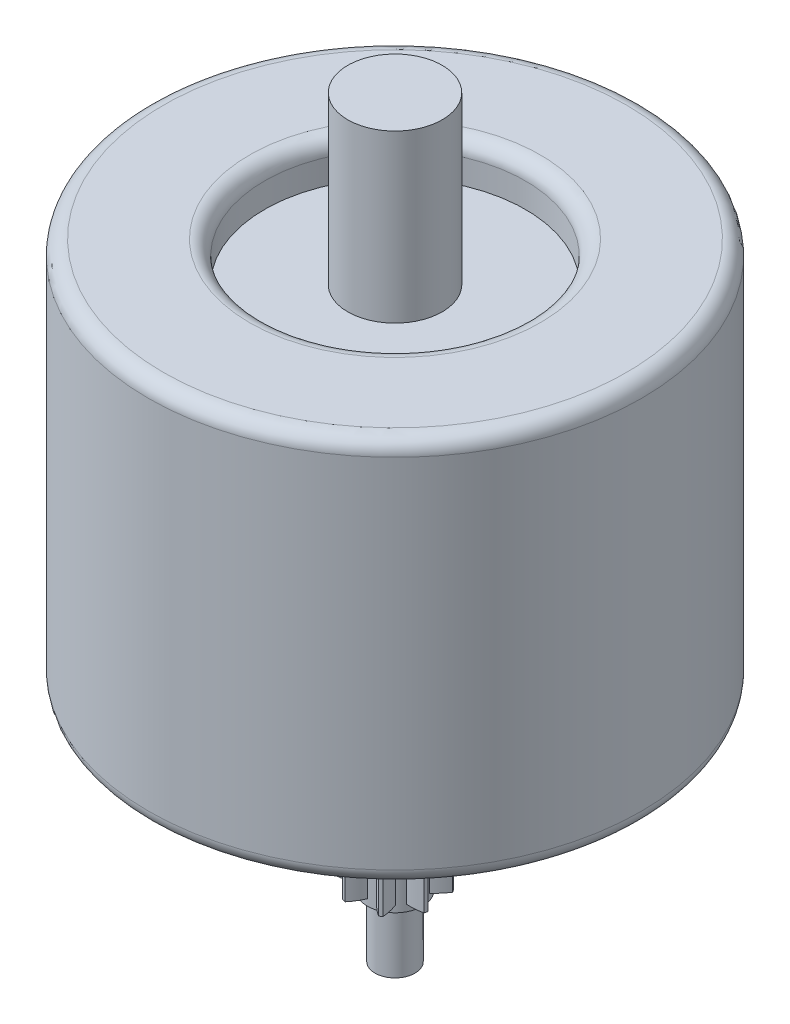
ISO-10303-21;
HEADER;
FILE_DESCRIPTION(('STEP AP214'),'2;1');
FILE_NAME('part.step','',(''),(''),'','','');
FILE_SCHEMA(('AUTOMOTIVE_DESIGN { 1 0 10303 214 1 1 1 1 }'));
ENDSEC;
DATA;
#1=APPLICATION_CONTEXT('core data for automotive mechanical design processes');
#2=APPLICATION_PROTOCOL_DEFINITION('international standard','automotive_design',2000,#1);
#3=PRODUCT_CONTEXT('',#1,'mechanical');
#4=PRODUCT('Part','Part','',(#3));
#5=PRODUCT_RELATED_PRODUCT_CATEGORY('part','',(#4));
#6=PRODUCT_DEFINITION_FORMATION('','',#4);
#7=PRODUCT_DEFINITION_CONTEXT('part definition',#1,'design');
#8=PRODUCT_DEFINITION('design','',#6,#7);
#9=PRODUCT_DEFINITION_SHAPE('','',#8);
#10=(LENGTH_UNIT() NAMED_UNIT(*) SI_UNIT(.MILLI.,.METRE.));
#11=(NAMED_UNIT(*) PLANE_ANGLE_UNIT() SI_UNIT($,.RADIAN.));
#12=(NAMED_UNIT(*) SI_UNIT($,.STERADIAN.) SOLID_ANGLE_UNIT());
#13=UNCERTAINTY_MEASURE_WITH_UNIT(LENGTH_MEASURE(1.E-05),#10,'distance_accuracy_value','');
#14=(GEOMETRIC_REPRESENTATION_CONTEXT(3) GLOBAL_UNCERTAINTY_ASSIGNED_CONTEXT((#13)) GLOBAL_UNIT_ASSIGNED_CONTEXT((#10,
#11,#12)) REPRESENTATION_CONTEXT('',''));
#15=CARTESIAN_POINT('',(0.,0.,0.));
#16=DIRECTION('',(0.,0.,1.));
#17=DIRECTION('',(1.,0.,0.));
#18=AXIS2_PLACEMENT_3D('',#15,#16,#17);
#19=CARTESIAN_POINT('',(-3.6398935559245,3.2,0.211839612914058));
#20=DIRECTION('',(0.,-1.,0.));
#21=DIRECTION('',(0.,0.,-1.));
#22=AXIS2_PLACEMENT_3D('',#19,#20,#21);
#23=CYLINDRICAL_SURFACE('',#22,4.);
#24=DIRECTION('',(0.,1.,0.));
#25=VECTOR('',#24,1.);
#26=CARTESIAN_POINT('',(0.0160026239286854,-4.3,1.83493022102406));
#27=LINE('',#26,#25);
#28=CARTESIAN_POINT('',(0.016002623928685,3.2,1.83493022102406));
#29=VERTEX_POINT('',#28);
#30=CARTESIAN_POINT('',(0.0160026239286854,-11.36,1.83493022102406));
#31=VERTEX_POINT('',#30);
#32=EDGE_CURVE('E61',#29,#31,#27,.F.);
#33=ORIENTED_EDGE('',*,*,#32,.F.);
#34=CARTESIAN_POINT('',(-3.6398935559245,3.2,0.211839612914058));
#35=DIRECTION('',(0.,1.,0.));
#36=DIRECTION('',(0.,0.,1.));
#37=AXIS2_PLACEMENT_3D('',#34,#35,#36);
#38=CIRCLE('',#37,4.);
#39=CARTESIAN_POINT('',(-0.563406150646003,3.2,2.76824827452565));
#40=VERTEX_POINT('',#39);
#41=EDGE_CURVE('E445',#40,#29,#38,.T.);
#42=ORIENTED_EDGE('',*,*,#41,.F.);
#43=DIRECTION('',(0.,-1.,0.));
#44=VECTOR('',#43,1.);
#45=CARTESIAN_POINT('',(-0.563406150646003,3.2,2.76824827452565));
#46=LINE('',#45,#44);
#47=CARTESIAN_POINT('',(-0.563406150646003,-11.36,2.76824827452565));
#48=VERTEX_POINT('',#47);
#49=EDGE_CURVE('E453',#40,#48,#46,.T.);
#50=ORIENTED_EDGE('',*,*,#49,.T.);
#51=CARTESIAN_POINT('',(-3.6398935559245,-11.36,0.211839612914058));
#52=DIRECTION('',(0.,1.,0.));
#53=DIRECTION('',(0.,0.,1.));
#54=AXIS2_PLACEMENT_3D('',#51,#52,#53);
#55=CIRCLE('',#54,4.);
#56=EDGE_CURVE('E442',#48,#31,#55,.T.);
#57=ORIENTED_EDGE('',*,*,#56,.T.);
#58=EDGE_LOOP('',(#33,#42,#50,#57));
#59=FACE_BOUND('',#58,.T.);
#60=ADVANCED_FACE('F45',(#59),#23,.T.);
#61=CARTESIAN_POINT('',(3.53426422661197,3.2,-0.895922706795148));
#62=DIRECTION('',(0.,-1.,0.));
#63=DIRECTION('',(0.,0.,-1.));
#64=AXIS2_PLACEMENT_3D('',#61,#62,#63);
#65=CYLINDRICAL_SURFACE('',#64,4.);
#66=DIRECTION('',(0.,1.,0.));
#67=VECTOR('',#66,1.);
#68=CARTESIAN_POINT('',(0.538210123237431,-4.3,1.75429611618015));
#69=LINE('',#68,#67);
#70=CARTESIAN_POINT('',(0.538210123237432,-11.36,1.75429611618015));
#71=VERTEX_POINT('',#70);
#72=CARTESIAN_POINT('',(0.538210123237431,3.2,1.75429611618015));
#73=VERTEX_POINT('',#72);
#74=EDGE_CURVE('E339',#71,#73,#69,.T.);
#75=ORIENTED_EDGE('',*,*,#74,.F.);
#76=CARTESIAN_POINT('',(3.53426422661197,-11.36,-0.895922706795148));
#77=DIRECTION('',(0.,1.,0.));
#78=DIRECTION('',(0.,0.,1.));
#79=AXIS2_PLACEMENT_3D('',#76,#77,#78);
#80=CIRCLE('',#79,4.);
#81=CARTESIAN_POINT('',(1.37214864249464,-11.36,2.46937909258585));
#82=VERTEX_POINT('',#81);
#83=EDGE_CURVE('E448',#71,#82,#80,.T.);
#84=ORIENTED_EDGE('',*,*,#83,.T.);
#85=DIRECTION('',(0.,-1.,0.));
#86=VECTOR('',#85,1.);
#87=CARTESIAN_POINT('',(1.37214864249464,3.2,2.46937909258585));
#88=LINE('',#87,#86);
#89=CARTESIAN_POINT('',(1.37214864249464,3.2,2.46937909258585));
#90=VERTEX_POINT('',#89);
#91=EDGE_CURVE('E450',#90,#82,#88,.T.);
#92=ORIENTED_EDGE('',*,*,#91,.F.);
#93=CARTESIAN_POINT('',(3.53426422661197,3.2,-0.895922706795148));
#94=DIRECTION('',(0.,1.,0.));
#95=DIRECTION('',(0.,0.,1.));
#96=AXIS2_PLACEMENT_3D('',#93,#94,#95);
#97=CIRCLE('',#96,4.);
#98=EDGE_CURVE('E447',#73,#90,#97,.T.);
#99=ORIENTED_EDGE('',*,*,#98,.F.);
#100=EDGE_LOOP('',(#75,#84,#92,#99));
#101=FACE_BOUND('',#100,.T.);
#102=ADVANCED_FACE('F535',(#101),#65,.T.);
#103=CARTESIAN_POINT('',(-2.72358664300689,3.2,-2.42400018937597));
#104=DIRECTION('',(0.,-1.,0.));
#105=DIRECTION('',(0.,0.,-1.));
#106=AXIS2_PLACEMENT_3D('',#103,#104,#105);
#107=CYLINDRICAL_SURFACE('',#106,4.);
#108=DIRECTION('',(0.,1.,0.));
#109=VECTOR('',#108,1.);
#110=CARTESIAN_POINT('',(-1.28617603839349,-4.3,1.30880716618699));
#111=LINE('',#110,#109);
#112=CARTESIAN_POINT('',(-1.28617603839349,3.2,1.30880716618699));
#113=VERTEX_POINT('',#112);
#114=CARTESIAN_POINT('',(-1.28617603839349,-11.36,1.30880716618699));
#115=VERTEX_POINT('',#114);
#116=EDGE_CURVE('E323',#113,#115,#111,.F.);
#117=ORIENTED_EDGE('',*,*,#116,.F.);
#118=CARTESIAN_POINT('',(-2.72358664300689,3.2,-2.42400018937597));
#119=DIRECTION('',(0.,1.,0.));
#120=DIRECTION('',(-0.707106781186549,0.,0.707106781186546));
#121=AXIS2_PLACEMENT_3D('',#118,#119,#120);
#122=CIRCLE('',#121,4.);
#123=CARTESIAN_POINT('',(-2.35583543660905,3.2,1.55905881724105));
#124=VERTEX_POINT('',#123);
#125=EDGE_CURVE('E430',#124,#113,#122,.T.);
#126=ORIENTED_EDGE('',*,*,#125,.F.);
#127=DIRECTION('',(0.,-1.,0.));
#128=VECTOR('',#127,1.);
#129=CARTESIAN_POINT('',(-2.35583543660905,3.2,1.55905881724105));
#130=LINE('',#129,#128);
#131=CARTESIAN_POINT('',(-2.35583543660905,-11.36,1.55905881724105));
#132=VERTEX_POINT('',#131);
#133=EDGE_CURVE('E440',#124,#132,#130,.T.);
#134=ORIENTED_EDGE('',*,*,#133,.T.);
#135=CARTESIAN_POINT('',(-2.72358664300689,-11.36,-2.42400018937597));
#136=DIRECTION('',(0.,1.,0.));
#137=DIRECTION('',(-0.707106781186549,0.,0.707106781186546));
#138=AXIS2_PLACEMENT_3D('',#135,#136,#137);
#139=CIRCLE('',#138,4.);
#140=EDGE_CURVE('E414',#132,#115,#139,.T.);
#141=ORIENTED_EDGE('',*,*,#140,.T.);
#142=EDGE_LOOP('',(#117,#126,#134,#141));
#143=FACE_BOUND('',#142,.T.);
#144=ADVANCED_FACE('F541',(#143),#107,.T.);
#145=CARTESIAN_POINT('',(3.13261522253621,3.2,1.86558917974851));
#146=DIRECTION('',(0.,-1.,0.));
#147=DIRECTION('',(0.,0.,-1.));
#148=AXIS2_PLACEMENT_3D('',#145,#146,#147);
#149=CYLINDRICAL_SURFACE('',#148,4.);
#150=DIRECTION('',(0.,1.,0.));
#151=VECTOR('',#150,1.);
#152=CARTESIAN_POINT('',(-0.859902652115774,-4.3,1.62104670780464));
#153=LINE('',#152,#151);
#154=CARTESIAN_POINT('',(-0.859902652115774,-11.36,1.62104670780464));
#155=VERTEX_POINT('',#154);
#156=CARTESIAN_POINT('',(-0.859902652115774,3.2,1.62104670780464));
#157=VERTEX_POINT('',#156);
#158=EDGE_CURVE('E342',#155,#157,#153,.T.);
#159=ORIENTED_EDGE('',*,*,#158,.F.);
#160=CARTESIAN_POINT('',(3.13261522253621,-11.36,1.86558917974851));
#161=DIRECTION('',(0.,1.,0.));
#162=DIRECTION('',(-0.707106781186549,0.,0.707106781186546));
#163=AXIS2_PLACEMENT_3D('',#160,#161,#162);
#164=CIRCLE('',#163,4.);
#165=CARTESIAN_POINT('',(-0.775859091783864,-11.36,2.71637031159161));
#166=VERTEX_POINT('',#165);
#167=EDGE_CURVE('E434',#155,#166,#164,.T.);
#168=ORIENTED_EDGE('',*,*,#167,.T.);
#169=DIRECTION('',(0.,-1.,0.));
#170=VECTOR('',#169,1.);
#171=CARTESIAN_POINT('',(-0.775859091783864,3.2,2.71637031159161));
#172=LINE('',#171,#170);
#173=CARTESIAN_POINT('',(-0.775859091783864,3.2,2.71637031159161));
#174=VERTEX_POINT('',#173);
#175=EDGE_CURVE('E436',#174,#166,#172,.T.);
#176=ORIENTED_EDGE('',*,*,#175,.F.);
#177=CARTESIAN_POINT('',(3.13261522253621,3.2,1.86558917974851));
#178=DIRECTION('',(0.,1.,0.));
#179=DIRECTION('',(-0.707106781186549,0.,0.707106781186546));
#180=AXIS2_PLACEMENT_3D('',#177,#178,#179);
#181=CIRCLE('',#180,4.);
#182=EDGE_CURVE('E433',#157,#174,#181,.T.);
#183=ORIENTED_EDGE('',*,*,#182,.F.);
#184=EDGE_LOOP('',(#159,#168,#176,#183));
#185=FACE_BOUND('',#184,.T.);
#186=ADVANCED_FACE('F856',(#185),#149,.T.);
#187=CARTESIAN_POINT('',(-2.424000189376,3.2,2.72358664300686));
#188=DIRECTION('',(0.,-1.,0.));
#189=DIRECTION('',(0.,0.,-1.));
#190=AXIS2_PLACEMENT_3D('',#187,#188,#189);
#191=CYLINDRICAL_SURFACE('',#190,4.);
#192=DIRECTION('',(0.,1.,0.));
#193=VECTOR('',#192,1.);
#194=CARTESIAN_POINT('',(1.30880716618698,-4.3,1.28617603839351));
#195=LINE('',#194,#193);
#196=CARTESIAN_POINT('',(1.30880716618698,3.2,1.28617603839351));
#197=VERTEX_POINT('',#196);
#198=CARTESIAN_POINT('',(1.30880716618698,-11.36,1.28617603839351));
#199=VERTEX_POINT('',#198);
#200=EDGE_CURVE('E334',#197,#199,#195,.F.);
#201=ORIENTED_EDGE('',*,*,#200,.F.);
#202=CARTESIAN_POINT('',(-2.424000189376,3.2,2.72358664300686));
#203=DIRECTION('',(0.,1.,0.));
#204=DIRECTION('',(0.707106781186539,0.,0.707106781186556));
#205=AXIS2_PLACEMENT_3D('',#202,#203,#204);
#206=CIRCLE('',#205,4.);
#207=CARTESIAN_POINT('',(1.55905881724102,3.2,2.35583543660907));
#208=VERTEX_POINT('',#207);
#209=EDGE_CURVE('E364',#208,#197,#206,.T.);
#210=ORIENTED_EDGE('',*,*,#209,.F.);
#211=DIRECTION('',(0.,-1.,0.));
#212=VECTOR('',#211,1.);
#213=CARTESIAN_POINT('',(1.55905881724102,3.2,2.35583543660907));
#214=LINE('',#213,#212);
#215=CARTESIAN_POINT('',(1.55905881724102,-11.36,2.35583543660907));
#216=VERTEX_POINT('',#215);
#217=EDGE_CURVE('E357',#208,#216,#214,.T.);
#218=ORIENTED_EDGE('',*,*,#217,.T.);
#219=CARTESIAN_POINT('',(-2.424000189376,-11.36,2.72358664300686));
#220=DIRECTION('',(0.,1.,0.));
#221=DIRECTION('',(0.707106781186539,0.,0.707106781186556));
#222=AXIS2_PLACEMENT_3D('',#219,#220,#221);
#223=CIRCLE('',#222,4.);
#224=EDGE_CURVE('E371',#216,#199,#223,.T.);
#225=ORIENTED_EDGE('',*,*,#224,.T.);
#226=EDGE_LOOP('',(#201,#210,#218,#225));
#227=FACE_BOUND('',#226,.T.);
#228=ADVANCED_FACE('F865',(#227),#191,.T.);
#229=CARTESIAN_POINT('',(1.86558917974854,3.2,-3.13261522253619));
#230=DIRECTION('',(0.,-1.,0.));
#231=DIRECTION('',(0.,0.,-1.));
#232=AXIS2_PLACEMENT_3D('',#229,#230,#231);
#233=CYLINDRICAL_SURFACE('',#232,4.);
#234=DIRECTION('',(0.,1.,0.));
#235=VECTOR('',#234,1.);
#236=CARTESIAN_POINT('',(1.62104670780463,-4.3,0.859902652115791));
#237=LINE('',#236,#235);
#238=CARTESIAN_POINT('',(1.62104670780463,-11.36,0.859902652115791));
#239=VERTEX_POINT('',#238);
#240=CARTESIAN_POINT('',(1.62104670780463,3.2,0.859902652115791));
#241=VERTEX_POINT('',#240);
#242=EDGE_CURVE('E331',#239,#241,#237,.T.);
#243=ORIENTED_EDGE('',*,*,#242,.F.);
#244=CARTESIAN_POINT('',(1.86558917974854,-11.36,-3.13261522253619));
#245=DIRECTION('',(0.,1.,0.));
#246=DIRECTION('',(0.707106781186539,0.,0.707106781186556));
#247=AXIS2_PLACEMENT_3D('',#244,#245,#246);
#248=CIRCLE('',#247,4.);
#249=CARTESIAN_POINT('',(2.7163703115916,-11.36,0.775859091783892));
#250=VERTEX_POINT('',#249);
#251=EDGE_CURVE('E368',#239,#250,#248,.T.);
#252=ORIENTED_EDGE('',*,*,#251,.T.);
#253=DIRECTION('',(0.,-1.,0.));
#254=VECTOR('',#253,1.);
#255=CARTESIAN_POINT('',(2.7163703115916,3.2,0.775859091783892));
#256=LINE('',#255,#254);
#257=CARTESIAN_POINT('',(2.7163703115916,3.2,0.775859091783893));
#258=VERTEX_POINT('',#257);
#259=EDGE_CURVE('E370',#258,#250,#256,.T.);
#260=ORIENTED_EDGE('',*,*,#259,.F.);
#261=CARTESIAN_POINT('',(1.86558917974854,3.2,-3.13261522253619));
#262=DIRECTION('',(0.,1.,0.));
#263=DIRECTION('',(0.707106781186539,0.,0.707106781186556));
#264=AXIS2_PLACEMENT_3D('',#261,#262,#263);
#265=CIRCLE('',#264,4.);
#266=EDGE_CURVE('E367',#241,#258,#265,.T.);
#267=ORIENTED_EDGE('',*,*,#266,.F.);
#268=EDGE_LOOP('',(#243,#252,#260,#267));
#269=FACE_BOUND('',#268,.T.);
#270=ADVANCED_FACE('F875',(#269),#233,.T.);
#271=CARTESIAN_POINT('',(0.21183961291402,3.2,3.6398935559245));
#272=DIRECTION('',(0.,-1.,0.));
#273=DIRECTION('',(0.,0.,-1.));
#274=AXIS2_PLACEMENT_3D('',#271,#272,#273);
#275=CYLINDRICAL_SURFACE('',#274,4.);
#276=DIRECTION('',(0.,1.,0.));
#277=VECTOR('',#276,1.);
#278=CARTESIAN_POINT('',(1.83493022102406,-4.3,-0.0160026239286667));
#279=LINE('',#278,#277);
#280=CARTESIAN_POINT('',(1.83493022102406,3.2,-0.0160026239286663));
#281=VERTEX_POINT('',#280);
#282=CARTESIAN_POINT('',(1.83493022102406,-11.36,-0.0160026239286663));
#283=VERTEX_POINT('',#282);
#284=EDGE_CURVE('E326',#281,#283,#279,.F.);
#285=ORIENTED_EDGE('',*,*,#284,.F.);
#286=CARTESIAN_POINT('',(0.21183961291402,3.2,3.6398935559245));
#287=DIRECTION('',(0.,1.,0.));
#288=DIRECTION('',(1.,0.,0.));
#289=AXIS2_PLACEMENT_3D('',#286,#287,#288);
#290=CIRCLE('',#289,4.);
#291=CARTESIAN_POINT('',(2.76824827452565,3.2,0.563406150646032));
#292=VERTEX_POINT('',#291);
#293=EDGE_CURVE('E347',#292,#281,#290,.T.);
#294=ORIENTED_EDGE('',*,*,#293,.F.);
#295=DIRECTION('',(0.,-1.,0.));
#296=VECTOR('',#295,1.);
#297=CARTESIAN_POINT('',(2.76824827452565,3.2,0.563406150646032));
#298=LINE('',#297,#296);
#299=CARTESIAN_POINT('',(2.76824827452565,-11.36,0.563406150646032));
#300=VERTEX_POINT('',#299);
#301=EDGE_CURVE('E359',#292,#300,#298,.T.);
#302=ORIENTED_EDGE('',*,*,#301,.T.);
#303=CARTESIAN_POINT('',(0.21183961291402,-11.36,3.6398935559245));
#304=DIRECTION('',(0.,1.,0.));
#305=DIRECTION('',(1.,0.,0.));
#306=AXIS2_PLACEMENT_3D('',#303,#304,#305);
#307=CIRCLE('',#306,4.);
#308=EDGE_CURVE('E354',#300,#283,#307,.T.);
#309=ORIENTED_EDGE('',*,*,#308,.T.);
#310=EDGE_LOOP('',(#285,#294,#302,#309));
#311=FACE_BOUND('',#310,.T.);
#312=ADVANCED_FACE('F885',(#311),#275,.T.);
#313=CARTESIAN_POINT('',(-0.895922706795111,3.2,-3.53426422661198));
#314=DIRECTION('',(0.,-1.,0.));
#315=DIRECTION('',(0.,0.,-1.));
#316=AXIS2_PLACEMENT_3D('',#313,#314,#315);
#317=CYLINDRICAL_SURFACE('',#316,4.);
#318=DIRECTION('',(0.,1.,0.));
#319=VECTOR('',#318,1.);
#320=CARTESIAN_POINT('',(1.75429611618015,-4.3,-0.538210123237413));
#321=LINE('',#320,#319);
#322=CARTESIAN_POINT('',(1.75429611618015,-11.36,-0.538210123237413));
#323=VERTEX_POINT('',#322);
#324=CARTESIAN_POINT('',(1.75429611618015,3.2,-0.538210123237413));
#325=VERTEX_POINT('',#324);
#326=EDGE_CURVE('E299',#323,#325,#321,.T.);
#327=ORIENTED_EDGE('',*,*,#326,.F.);
#328=CARTESIAN_POINT('',(-0.895922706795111,-11.36,-3.53426422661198));
#329=DIRECTION('',(0.,1.,0.));
#330=DIRECTION('',(1.,0.,0.));
#331=AXIS2_PLACEMENT_3D('',#328,#329,#330);
#332=CIRCLE('',#331,4.);
#333=CARTESIAN_POINT('',(2.46937909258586,-11.36,-1.37214864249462));
#334=VERTEX_POINT('',#333);
#335=EDGE_CURVE('E351',#323,#334,#332,.T.);
#336=ORIENTED_EDGE('',*,*,#335,.T.);
#337=DIRECTION('',(0.,-1.,0.));
#338=VECTOR('',#337,1.);
#339=CARTESIAN_POINT('',(2.46937909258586,3.2,-1.37214864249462));
#340=LINE('',#339,#338);
#341=CARTESIAN_POINT('',(2.46937909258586,3.2,-1.37214864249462));
#342=VERTEX_POINT('',#341);
#343=EDGE_CURVE('E353',#342,#334,#340,.T.);
#344=ORIENTED_EDGE('',*,*,#343,.F.);
#345=CARTESIAN_POINT('',(-0.895922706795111,3.2,-3.53426422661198));
#346=DIRECTION('',(0.,1.,0.));
#347=DIRECTION('',(1.,0.,0.));
#348=AXIS2_PLACEMENT_3D('',#345,#346,#347);
#349=CIRCLE('',#348,4.);
#350=EDGE_CURVE('E350',#325,#342,#349,.T.);
#351=ORIENTED_EDGE('',*,*,#350,.F.);
#352=EDGE_LOOP('',(#327,#336,#344,#351));
#353=FACE_BOUND('',#352,.T.);
#354=ADVANCED_FACE('F895',(#353),#317,.T.);
#355=CARTESIAN_POINT('',(-0.211839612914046,3.2,-3.6398935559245));
#356=DIRECTION('',(0.,-1.,0.));
#357=DIRECTION('',(0.,0.,-1.));
#358=AXIS2_PLACEMENT_3D('',#355,#356,#357);
#359=CYLINDRICAL_SURFACE('',#358,4.);
#360=DIRECTION('',(0.,1.,0.));
#361=VECTOR('',#360,1.);
#362=CARTESIAN_POINT('',(-1.83493022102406,-4.3,0.0160026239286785));
#363=LINE('',#362,#361);
#364=CARTESIAN_POINT('',(-1.83493022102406,3.2,0.0160026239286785));
#365=VERTEX_POINT('',#364);
#366=CARTESIAN_POINT('',(-1.83493022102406,-11.36,0.0160026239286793));
#367=VERTEX_POINT('',#366);
#368=EDGE_CURVE('E315',#365,#367,#363,.F.);
#369=ORIENTED_EDGE('',*,*,#368,.F.);
#370=CARTESIAN_POINT('',(-0.211839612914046,3.2,-3.6398935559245));
#371=DIRECTION('',(0.,1.,0.));
#372=DIRECTION('',(-1.,0.,0.));
#373=AXIS2_PLACEMENT_3D('',#370,#371,#372);
#374=CIRCLE('',#373,4.);
#375=CARTESIAN_POINT('',(-2.76824827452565,3.2,-0.563406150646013));
#376=VERTEX_POINT('',#375);
#377=EDGE_CURVE('E400',#376,#365,#374,.T.);
#378=ORIENTED_EDGE('',*,*,#377,.F.);
#379=DIRECTION('',(0.,-1.,0.));
#380=VECTOR('',#379,1.);
#381=CARTESIAN_POINT('',(-2.76824827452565,3.2,-0.563406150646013));
#382=LINE('',#381,#380);
#383=CARTESIAN_POINT('',(-2.76824827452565,-11.36,-0.563406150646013));
#384=VERTEX_POINT('',#383);
#385=EDGE_CURVE('E412',#376,#384,#382,.T.);
#386=ORIENTED_EDGE('',*,*,#385,.T.);
#387=CARTESIAN_POINT('',(-0.211839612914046,-11.36,-3.6398935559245));
#388=DIRECTION('',(0.,1.,0.));
#389=DIRECTION('',(-1.,0.,0.));
#390=AXIS2_PLACEMENT_3D('',#387,#388,#389);
#391=CIRCLE('',#390,4.);
#392=EDGE_CURVE('E407',#384,#367,#391,.T.);
#393=ORIENTED_EDGE('',*,*,#392,.T.);
#394=EDGE_LOOP('',(#369,#378,#386,#393));
#395=FACE_BOUND('',#394,.T.);
#396=ADVANCED_FACE('F905',(#395),#359,.T.);
#397=CARTESIAN_POINT('',(0.895922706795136,3.2,3.53426422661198));
#398=DIRECTION('',(0.,-1.,0.));
#399=DIRECTION('',(0.,0.,-1.));
#400=AXIS2_PLACEMENT_3D('',#397,#398,#399);
#401=CYLINDRICAL_SURFACE('',#400,4.);
#402=DIRECTION('',(0.,1.,0.));
#403=VECTOR('',#402,1.);
#404=CARTESIAN_POINT('',(-1.75429611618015,-4.3,0.538210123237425));
#405=LINE('',#404,#403);
#406=CARTESIAN_POINT('',(-1.75429611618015,-11.36,0.538210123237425));
#407=VERTEX_POINT('',#406);
#408=CARTESIAN_POINT('',(-1.75429611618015,3.2,0.538210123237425));
#409=VERTEX_POINT('',#408);
#410=EDGE_CURVE('E318',#407,#409,#405,.T.);
#411=ORIENTED_EDGE('',*,*,#410,.F.);
#412=CARTESIAN_POINT('',(0.895922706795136,-11.36,3.53426422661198));
#413=DIRECTION('',(0.,1.,0.));
#414=DIRECTION('',(-1.,0.,0.));
#415=AXIS2_PLACEMENT_3D('',#412,#413,#414);
#416=CIRCLE('',#415,4.);
#417=CARTESIAN_POINT('',(-2.46937909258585,-11.36,1.37214864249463));
#418=VERTEX_POINT('',#417);
#419=EDGE_CURVE('E404',#407,#418,#416,.T.);
#420=ORIENTED_EDGE('',*,*,#419,.T.);
#421=DIRECTION('',(0.,-1.,0.));
#422=VECTOR('',#421,1.);
#423=CARTESIAN_POINT('',(-2.46937909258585,3.2,1.37214864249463));
#424=LINE('',#423,#422);
#425=CARTESIAN_POINT('',(-2.46937909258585,3.2,1.37214864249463));
#426=VERTEX_POINT('',#425);
#427=EDGE_CURVE('E406',#426,#418,#424,.T.);
#428=ORIENTED_EDGE('',*,*,#427,.F.);
#429=CARTESIAN_POINT('',(0.895922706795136,3.2,3.53426422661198));
#430=DIRECTION('',(0.,1.,0.));
#431=DIRECTION('',(-1.,0.,0.));
#432=AXIS2_PLACEMENT_3D('',#429,#430,#431);
#433=CIRCLE('',#432,4.);
#434=EDGE_CURVE('E403',#409,#426,#433,.T.);
#435=ORIENTED_EDGE('',*,*,#434,.F.);
#436=EDGE_LOOP('',(#411,#420,#428,#435));
#437=FACE_BOUND('',#436,.T.);
#438=ADVANCED_FACE('F915',(#437),#401,.T.);
#439=CARTESIAN_POINT('',(2.42400018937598,3.2,-2.72358664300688));
#440=DIRECTION('',(0.,-1.,0.));
#441=DIRECTION('',(0.,0.,-1.));
#442=AXIS2_PLACEMENT_3D('',#439,#440,#441);
#443=CYLINDRICAL_SURFACE('',#442,4.);
#444=DIRECTION('',(0.,1.,0.));
#445=VECTOR('',#444,1.);
#446=CARTESIAN_POINT('',(-1.30880716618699,-4.3,-1.2861760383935));
#447=LINE('',#446,#445);
#448=CARTESIAN_POINT('',(-1.30880716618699,3.2,-1.2861760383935));
#449=VERTEX_POINT('',#448);
#450=CARTESIAN_POINT('',(-1.30880716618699,-11.36,-1.2861760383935));
#451=VERTEX_POINT('',#450);
#452=EDGE_CURVE('E307',#449,#451,#447,.F.);
#453=ORIENTED_EDGE('',*,*,#452,.F.);
#454=CARTESIAN_POINT('',(2.42400018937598,3.2,-2.72358664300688));
#455=DIRECTION('',(0.,1.,0.));
#456=DIRECTION('',(-0.707106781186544,0.,-0.707106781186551));
#457=AXIS2_PLACEMENT_3D('',#454,#455,#456);
#458=CIRCLE('',#457,4.);
#459=CARTESIAN_POINT('',(-1.55905881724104,3.2,-2.35583543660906));
#460=VERTEX_POINT('',#459);
#461=EDGE_CURVE('E417',#460,#449,#458,.T.);
#462=ORIENTED_EDGE('',*,*,#461,.F.);
#463=DIRECTION('',(0.,-1.,0.));
#464=VECTOR('',#463,1.);
#465=CARTESIAN_POINT('',(-1.55905881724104,3.2,-2.35583543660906));
#466=LINE('',#465,#464);
#467=CARTESIAN_POINT('',(-1.55905881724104,-11.36,-2.35583543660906));
#468=VERTEX_POINT('',#467);
#469=EDGE_CURVE('E410',#460,#468,#466,.T.);
#470=ORIENTED_EDGE('',*,*,#469,.T.);
#471=CARTESIAN_POINT('',(2.42400018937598,-11.36,-2.72358664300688));
#472=DIRECTION('',(0.,1.,0.));
#473=DIRECTION('',(-0.707106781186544,0.,-0.707106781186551));
#474=AXIS2_PLACEMENT_3D('',#471,#472,#473);
#475=CIRCLE('',#474,4.);
#476=EDGE_CURVE('E390',#468,#451,#475,.T.);
#477=ORIENTED_EDGE('',*,*,#476,.T.);
#478=EDGE_LOOP('',(#453,#462,#470,#477));
#479=FACE_BOUND('',#478,.T.);
#480=ADVANCED_FACE('F925',(#479),#443,.T.);
#481=CARTESIAN_POINT('',(-1.86558917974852,3.2,3.1326152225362));
#482=DIRECTION('',(0.,-1.,0.));
#483=DIRECTION('',(0.,0.,-1.));
#484=AXIS2_PLACEMENT_3D('',#481,#482,#483);
#485=CYLINDRICAL_SURFACE('',#484,4.);
#486=DIRECTION('',(0.,1.,0.));
#487=VECTOR('',#486,1.);
#488=CARTESIAN_POINT('',(-1.62104670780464,-4.3,-0.85990265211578));
#489=LINE('',#488,#487);
#490=CARTESIAN_POINT('',(-1.62104670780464,-11.36,-0.85990265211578));
#491=VERTEX_POINT('',#490);
#492=CARTESIAN_POINT('',(-1.62104670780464,3.2,-0.85990265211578));
#493=VERTEX_POINT('',#492);
#494=EDGE_CURVE('E310',#491,#493,#489,.T.);
#495=ORIENTED_EDGE('',*,*,#494,.F.);
#496=CARTESIAN_POINT('',(-1.86558917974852,-11.36,3.1326152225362));
#497=DIRECTION('',(0.,1.,0.));
#498=DIRECTION('',(-0.707106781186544,0.,-0.707106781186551));
#499=AXIS2_PLACEMENT_3D('',#496,#497,#498);
#500=CIRCLE('',#499,4.);
#501=CARTESIAN_POINT('',(-2.71637031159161,-11.36,-0.775859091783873));
#502=VERTEX_POINT('',#501);
#503=EDGE_CURVE('E421',#491,#502,#500,.T.);
#504=ORIENTED_EDGE('',*,*,#503,.T.);
#505=DIRECTION('',(0.,-1.,0.));
#506=VECTOR('',#505,1.);
#507=CARTESIAN_POINT('',(-2.71637031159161,3.2,-0.775859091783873));
#508=LINE('',#507,#506);
#509=CARTESIAN_POINT('',(-2.71637031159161,3.2,-0.775859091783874));
#510=VERTEX_POINT('',#509);
#511=EDGE_CURVE('E423',#510,#502,#508,.T.);
#512=ORIENTED_EDGE('',*,*,#511,.F.);
#513=CARTESIAN_POINT('',(-1.86558917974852,3.2,3.1326152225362));
#514=DIRECTION('',(0.,1.,0.));
#515=DIRECTION('',(-0.707106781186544,0.,-0.707106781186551));
#516=AXIS2_PLACEMENT_3D('',#513,#514,#515);
#517=CIRCLE('',#516,4.);
#518=EDGE_CURVE('E420',#493,#510,#517,.T.);
#519=ORIENTED_EDGE('',*,*,#518,.F.);
#520=EDGE_LOOP('',(#495,#504,#512,#519));
#521=FACE_BOUND('',#520,.T.);
#522=ADVANCED_FACE('F935',(#521),#485,.T.);
#523=CARTESIAN_POINT('',(3.6398935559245,3.2,-0.211839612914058));
#524=DIRECTION('',(0.,-1.,0.));
#525=DIRECTION('',(0.,0.,-1.));
#526=AXIS2_PLACEMENT_3D('',#523,#524,#525);
#527=CYLINDRICAL_SURFACE('',#526,4.);
#528=DIRECTION('',(0.,1.,0.));
#529=VECTOR('',#528,1.);
#530=CARTESIAN_POINT('',(-0.0160026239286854,-4.3,-1.83493022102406));
#531=LINE('',#530,#529);
#532=CARTESIAN_POINT('',(-0.016002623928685,3.2,-1.83493022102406));
#533=VERTEX_POINT('',#532);
#534=CARTESIAN_POINT('',(-0.0160026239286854,-11.36,-1.83493022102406));
#535=VERTEX_POINT('',#534);
#536=EDGE_CURVE('E286',#533,#535,#531,.F.);
#537=ORIENTED_EDGE('',*,*,#536,.F.);
#538=CARTESIAN_POINT('',(3.6398935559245,3.2,-0.211839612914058));
#539=DIRECTION('',(0.,1.,0.));
#540=DIRECTION('',(0.,0.,-1.));
#541=AXIS2_PLACEMENT_3D('',#538,#539,#540);
#542=CIRCLE('',#541,4.);
#543=CARTESIAN_POINT('',(0.563406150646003,3.2,-2.76824827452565));
#544=VERTEX_POINT('',#543);
#545=EDGE_CURVE('E378',#544,#533,#542,.T.);
#546=ORIENTED_EDGE('',*,*,#545,.F.);
#547=DIRECTION('',(0.,-1.,0.));
#548=VECTOR('',#547,1.);
#549=CARTESIAN_POINT('',(0.563406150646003,3.2,-2.76824827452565));
#550=LINE('',#549,#548);
#551=CARTESIAN_POINT('',(0.563406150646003,-11.36,-2.76824827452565));
#552=VERTEX_POINT('',#551);
#553=EDGE_CURVE('E388',#544,#552,#550,.T.);
#554=ORIENTED_EDGE('',*,*,#553,.T.);
#555=CARTESIAN_POINT('',(3.6398935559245,-11.36,-0.211839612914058));
#556=DIRECTION('',(0.,1.,0.));
#557=DIRECTION('',(0.,0.,-1.));
#558=AXIS2_PLACEMENT_3D('',#555,#556,#557);
#559=CIRCLE('',#558,4.);
#560=EDGE_CURVE('E384',#552,#535,#559,.T.);
#561=ORIENTED_EDGE('',*,*,#560,.T.);
#562=EDGE_LOOP('',(#537,#546,#554,#561));
#563=FACE_BOUND('',#562,.T.);
#564=ADVANCED_FACE('F945',(#563),#527,.T.);
#565=CARTESIAN_POINT('',(-3.53426422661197,3.2,0.895922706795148));
#566=DIRECTION('',(0.,-1.,0.));
#567=DIRECTION('',(0.,0.,-1.));
#568=AXIS2_PLACEMENT_3D('',#565,#566,#567);
#569=CYLINDRICAL_SURFACE('',#568,4.);
#570=DIRECTION('',(0.,1.,0.));
#571=VECTOR('',#570,1.);
#572=CARTESIAN_POINT('',(-0.538210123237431,-4.3,-1.75429611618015));
#573=LINE('',#572,#571);
#574=CARTESIAN_POINT('',(-0.538210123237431,-11.36,-1.75429611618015));
#575=VERTEX_POINT('',#574);
#576=CARTESIAN_POINT('',(-0.538210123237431,3.2,-1.75429611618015));
#577=VERTEX_POINT('',#576);
#578=EDGE_CURVE('E302',#575,#577,#573,.T.);
#579=ORIENTED_EDGE('',*,*,#578,.F.);
#580=CARTESIAN_POINT('',(-3.53426422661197,-11.36,0.895922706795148));
#581=DIRECTION('',(0.,1.,0.));
#582=DIRECTION('',(0.,0.,-1.));
#583=AXIS2_PLACEMENT_3D('',#580,#581,#582);
#584=CIRCLE('',#583,4.);
#585=CARTESIAN_POINT('',(-1.37214864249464,-11.36,-2.46937909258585));
#586=VERTEX_POINT('',#585);
#587=EDGE_CURVE('E381',#575,#586,#584,.T.);
#588=ORIENTED_EDGE('',*,*,#587,.T.);
#589=DIRECTION('',(0.,-1.,0.));
#590=VECTOR('',#589,1.);
#591=CARTESIAN_POINT('',(-1.37214864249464,3.2,-2.46937909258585));
#592=LINE('',#591,#590);
#593=CARTESIAN_POINT('',(-1.37214864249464,3.2,-2.46937909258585));
#594=VERTEX_POINT('',#593);
#595=EDGE_CURVE('E383',#594,#586,#592,.T.);
#596=ORIENTED_EDGE('',*,*,#595,.F.);
#597=CARTESIAN_POINT('',(-3.53426422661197,3.2,0.895922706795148));
#598=DIRECTION('',(0.,1.,0.));
#599=DIRECTION('',(0.,0.,-1.));
#600=AXIS2_PLACEMENT_3D('',#597,#598,#599);
#601=CIRCLE('',#600,4.);
#602=EDGE_CURVE('E380',#577,#594,#601,.T.);
#603=ORIENTED_EDGE('',*,*,#602,.F.);
#604=EDGE_LOOP('',(#579,#588,#596,#603));
#605=FACE_BOUND('',#604,.T.);
#606=ADVANCED_FACE('F955',(#605),#569,.T.);
#607=CARTESIAN_POINT('',(2.72358664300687,3.2,2.42400018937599));
#608=DIRECTION('',(0.,-1.,0.));
#609=DIRECTION('',(0.,0.,-1.));
#610=AXIS2_PLACEMENT_3D('',#607,#608,#609);
#611=CYLINDRICAL_SURFACE('',#610,4.);
#612=DIRECTION('',(0.,1.,0.));
#613=VECTOR('',#612,1.);
#614=CARTESIAN_POINT('',(1.2861760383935,-4.3,-1.30880716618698));
#615=LINE('',#614,#613);
#616=CARTESIAN_POINT('',(1.2861760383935,3.2,-1.30880716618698));
#617=VERTEX_POINT('',#616);
#618=CARTESIAN_POINT('',(1.2861760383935,-11.36,-1.30880716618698));
#619=VERTEX_POINT('',#618);
#620=EDGE_CURVE('E291',#617,#619,#615,.F.);
#621=ORIENTED_EDGE('',*,*,#620,.F.);
#622=CARTESIAN_POINT('',(2.72358664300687,3.2,2.42400018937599));
#623=DIRECTION('',(0.,1.,0.));
#624=DIRECTION('',(0.707106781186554,0.,-0.707106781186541));
#625=AXIS2_PLACEMENT_3D('',#622,#623,#624);
#626=CIRCLE('',#625,4.);
#627=CARTESIAN_POINT('',(2.35583543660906,3.2,-1.55905881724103));
#628=VERTEX_POINT('',#627);
#629=EDGE_CURVE('E265',#628,#617,#626,.T.);
#630=ORIENTED_EDGE('',*,*,#629,.F.);
#631=DIRECTION('',(0.,-1.,0.));
#632=VECTOR('',#631,1.);
#633=CARTESIAN_POINT('',(2.35583543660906,3.2,-1.55905881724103));
#634=LINE('',#633,#632);
#635=CARTESIAN_POINT('',(2.35583543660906,-11.36,-1.55905881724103));
#636=VERTEX_POINT('',#635);
#637=EDGE_CURVE('E386',#628,#636,#634,.T.);
#638=ORIENTED_EDGE('',*,*,#637,.T.);
#639=CARTESIAN_POINT('',(2.72358664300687,-11.36,2.42400018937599));
#640=DIRECTION('',(0.,1.,0.));
#641=DIRECTION('',(0.707106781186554,0.,-0.707106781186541));
#642=AXIS2_PLACEMENT_3D('',#639,#640,#641);
#643=CIRCLE('',#642,4.);
#644=EDGE_CURVE('E361',#636,#619,#643,.T.);
#645=ORIENTED_EDGE('',*,*,#644,.T.);
#646=EDGE_LOOP('',(#621,#630,#638,#645));
#647=FACE_BOUND('',#646,.T.);
#648=ADVANCED_FACE('F965',(#647),#611,.T.);
#649=CARTESIAN_POINT('',(-3.1326152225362,3.2,-1.86558917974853));
#650=DIRECTION('',(0.,-1.,0.));
#651=DIRECTION('',(0.,0.,-1.));
#652=AXIS2_PLACEMENT_3D('',#649,#650,#651);
#653=CYLINDRICAL_SURFACE('',#652,4.);
#654=DIRECTION('',(0.,1.,0.));
#655=VECTOR('',#654,1.);
#656=CARTESIAN_POINT('',(0.859902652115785,-4.3,-1.62104670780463));
#657=LINE('',#656,#655);
#658=CARTESIAN_POINT('',(0.859902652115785,-11.36,-1.62104670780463));
#659=VERTEX_POINT('',#658);
#660=CARTESIAN_POINT('',(0.859902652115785,3.2,-1.62104670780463));
#661=VERTEX_POINT('',#660);
#662=EDGE_CURVE('E11',#659,#661,#657,.T.);
#663=ORIENTED_EDGE('',*,*,#662,.F.);
#664=CARTESIAN_POINT('',(-3.1326152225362,-11.36,-1.86558917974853));
#665=DIRECTION('',(0.,1.,0.));
#666=DIRECTION('',(0.707106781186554,0.,-0.707106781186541));
#667=AXIS2_PLACEMENT_3D('',#664,#665,#666);
#668=CIRCLE('',#667,4.);
#669=CARTESIAN_POINT('',(0.775859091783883,-11.36,-2.71637031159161));
#670=VERTEX_POINT('',#669);
#671=EDGE_CURVE('E393',#659,#670,#668,.T.);
#672=ORIENTED_EDGE('',*,*,#671,.T.);
#673=DIRECTION('',(0.,-1.,0.));
#674=VECTOR('',#673,1.);
#675=CARTESIAN_POINT('',(0.775859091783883,3.2,-2.71637031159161));
#676=LINE('',#675,#674);
#677=CARTESIAN_POINT('',(0.775859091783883,3.2,-2.71637031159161));
#678=VERTEX_POINT('',#677);
#679=EDGE_CURVE('E261',#678,#670,#676,.T.);
#680=ORIENTED_EDGE('',*,*,#679,.F.);
#681=CARTESIAN_POINT('',(-3.1326152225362,3.2,-1.86558917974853));
#682=DIRECTION('',(0.,1.,0.));
#683=DIRECTION('',(0.707106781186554,0.,-0.707106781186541));
#684=AXIS2_PLACEMENT_3D('',#681,#682,#683);
#685=CIRCLE('',#684,4.);
#686=EDGE_CURVE('E256',#661,#678,#685,.T.);
#687=ORIENTED_EDGE('',*,*,#686,.F.);
#688=EDGE_LOOP('',(#663,#672,#680,#687));
#689=FACE_BOUND('',#688,.T.);
#690=ADVANCED_FACE('F258',(#689),#653,.T.);
#691=CARTESIAN_POINT('',(0.,-11.36,0.));
#692=DIRECTION('',(0.,-1.,0.));
#693=DIRECTION('',(0.,0.,-1.));
#694=AXIS2_PLACEMENT_3D('',#691,#692,#693);
#695=PLANE('',#694);
#696=ORIENTED_EDGE('',*,*,#335,.F.);
#697=CARTESIAN_POINT('',(0.,-11.36,0.));
#698=DIRECTION('',(0.,-1.,0.));
#699=DIRECTION('',(0.,0.,-1.));
#700=AXIS2_PLACEMENT_3D('',#697,#698,#699);
#701=CIRCLE('',#700,1.835);
#702=EDGE_CURVE('E297',#323,#619,#701,.F.);
#703=ORIENTED_EDGE('',*,*,#702,.T.);
#704=ORIENTED_EDGE('',*,*,#644,.F.);
#705=CARTESIAN_POINT('',(0.,-11.36,0.));
#706=DIRECTION('',(0.,-1.,0.));
#707=DIRECTION('',(0.,0.,-1.));
#708=AXIS2_PLACEMENT_3D('',#705,#706,#707);
#709=CIRCLE('',#708,2.825);
#710=EDGE_CURVE('E991',#636,#334,#709,.T.);
#711=ORIENTED_EDGE('',*,*,#710,.T.);
#712=EDGE_LOOP('',(#696,#703,#704,#711));
#713=FACE_BOUND('',#712,.T.);
#714=ADVANCED_FACE('F546',(#713),#695,.T.);
#715=ORIENTED_EDGE('',*,*,#671,.F.);
#716=CARTESIAN_POINT('',(0.,-11.36,0.));
#717=DIRECTION('',(0.,-1.,0.));
#718=DIRECTION('',(0.,0.,-1.));
#719=AXIS2_PLACEMENT_3D('',#716,#717,#718);
#720=CIRCLE('',#719,1.835);
#721=EDGE_CURVE('E284',#659,#535,#720,.F.);
#722=ORIENTED_EDGE('',*,*,#721,.T.);
#723=ORIENTED_EDGE('',*,*,#560,.F.);
#724=EDGE_CURVE('E1017',#552,#670,#709,.T.);
#725=ORIENTED_EDGE('',*,*,#724,.T.);
#726=EDGE_LOOP('',(#715,#722,#723,#725));
#727=FACE_BOUND('',#726,.T.);
#728=ADVANCED_FACE('F549',(#727),#695,.T.);
#729=ORIENTED_EDGE('',*,*,#587,.F.);
#730=CARTESIAN_POINT('',(0.,-11.36,0.));
#731=DIRECTION('',(0.,-1.,0.));
#732=DIRECTION('',(0.,0.,-1.));
#733=AXIS2_PLACEMENT_3D('',#730,#731,#732);
#734=CIRCLE('',#733,1.835);
#735=EDGE_CURVE('E305',#575,#451,#734,.F.);
#736=ORIENTED_EDGE('',*,*,#735,.T.);
#737=ORIENTED_EDGE('',*,*,#476,.F.);
#738=EDGE_CURVE('E1019',#468,#586,#709,.T.);
#739=ORIENTED_EDGE('',*,*,#738,.T.);
#740=EDGE_LOOP('',(#729,#736,#737,#739));
#741=FACE_BOUND('',#740,.T.);
#742=ADVANCED_FACE('F764',(#741),#695,.T.);
#743=ORIENTED_EDGE('',*,*,#503,.F.);
#744=CARTESIAN_POINT('',(0.,-11.36,0.));
#745=DIRECTION('',(0.,-1.,0.));
#746=DIRECTION('',(0.,0.,-1.));
#747=AXIS2_PLACEMENT_3D('',#744,#745,#746);
#748=CIRCLE('',#747,1.835);
#749=EDGE_CURVE('E313',#491,#367,#748,.F.);
#750=ORIENTED_EDGE('',*,*,#749,.T.);
#751=ORIENTED_EDGE('',*,*,#392,.F.);
#752=EDGE_CURVE('E1022',#384,#502,#709,.T.);
#753=ORIENTED_EDGE('',*,*,#752,.T.);
#754=EDGE_LOOP('',(#743,#750,#751,#753));
#755=FACE_BOUND('',#754,.T.);
#756=ADVANCED_FACE('F772',(#755),#695,.T.);
#757=ORIENTED_EDGE('',*,*,#419,.F.);
#758=CARTESIAN_POINT('',(0.,-11.36,0.));
#759=DIRECTION('',(0.,-1.,0.));
#760=DIRECTION('',(0.,0.,-1.));
#761=AXIS2_PLACEMENT_3D('',#758,#759,#760);
#762=CIRCLE('',#761,1.835);
#763=EDGE_CURVE('E321',#407,#115,#762,.F.);
#764=ORIENTED_EDGE('',*,*,#763,.T.);
#765=ORIENTED_EDGE('',*,*,#140,.F.);
#766=EDGE_CURVE('E462',#132,#418,#709,.T.);
#767=ORIENTED_EDGE('',*,*,#766,.T.);
#768=EDGE_LOOP('',(#757,#764,#765,#767));
#769=FACE_BOUND('',#768,.T.);
#770=ADVANCED_FACE('F780',(#769),#695,.T.);
#771=ORIENTED_EDGE('',*,*,#251,.F.);
#772=CARTESIAN_POINT('',(0.,-11.36,0.));
#773=DIRECTION('',(0.,-1.,0.));
#774=DIRECTION('',(0.,0.,-1.));
#775=AXIS2_PLACEMENT_3D('',#772,#773,#774);
#776=CIRCLE('',#775,1.835);
#777=EDGE_CURVE('E329',#239,#283,#776,.F.);
#778=ORIENTED_EDGE('',*,*,#777,.T.);
#779=ORIENTED_EDGE('',*,*,#308,.F.);
#780=EDGE_CURVE('E1012',#300,#250,#709,.T.);
#781=ORIENTED_EDGE('',*,*,#780,.T.);
#782=EDGE_LOOP('',(#771,#778,#779,#781));
#783=FACE_BOUND('',#782,.T.);
#784=ADVANCED_FACE('F789',(#783),#695,.T.);
#785=ORIENTED_EDGE('',*,*,#83,.F.);
#786=CARTESIAN_POINT('',(0.,-11.36,0.));
#787=DIRECTION('',(0.,-1.,0.));
#788=DIRECTION('',(0.,0.,-1.));
#789=AXIS2_PLACEMENT_3D('',#786,#787,#788);
#790=CIRCLE('',#789,1.835);
#791=EDGE_CURVE('E337',#71,#199,#790,.F.);
#792=ORIENTED_EDGE('',*,*,#791,.T.);
#793=ORIENTED_EDGE('',*,*,#224,.F.);
#794=EDGE_CURVE('E463',#216,#82,#709,.T.);
#795=ORIENTED_EDGE('',*,*,#794,.T.);
#796=EDGE_LOOP('',(#785,#792,#793,#795));
#797=FACE_BOUND('',#796,.T.);
#798=ADVANCED_FACE('F797',(#797),#695,.T.);
#799=ORIENTED_EDGE('',*,*,#167,.F.);
#800=CARTESIAN_POINT('',(0.,-11.36,0.));
#801=DIRECTION('',(0.,-1.,0.));
#802=DIRECTION('',(0.,0.,-1.));
#803=AXIS2_PLACEMENT_3D('',#800,#801,#802);
#804=CIRCLE('',#803,1.835);
#805=EDGE_CURVE('E69',#155,#31,#804,.F.);
#806=ORIENTED_EDGE('',*,*,#805,.T.);
#807=ORIENTED_EDGE('',*,*,#56,.F.);
#808=EDGE_CURVE('E458',#48,#166,#709,.T.);
#809=ORIENTED_EDGE('',*,*,#808,.T.);
#810=EDGE_LOOP('',(#799,#806,#807,#809));
#811=FACE_BOUND('',#810,.T.);
#812=ADVANCED_FACE('F551',(#811),#695,.T.);
#813=CARTESIAN_POINT('',(0.,-11.36,0.));
#814=DIRECTION('',(0.,1.,0.));
#815=DIRECTION('',(0.,0.,1.));
#816=AXIS2_PLACEMENT_3D('',#813,#814,#815);
#817=CYLINDRICAL_SURFACE('',#816,2.825);
#818=ORIENTED_EDGE('',*,*,#710,.F.);
#819=ORIENTED_EDGE('',*,*,#637,.F.);
#820=CARTESIAN_POINT('',(0.,3.2,0.));
#821=DIRECTION('',(0.,-1.,0.));
#822=DIRECTION('',(0.,0.,-1.));
#823=AXIS2_PLACEMENT_3D('',#820,#821,#822);
#824=CIRCLE('',#823,2.825);
#825=EDGE_CURVE('E995',#628,#342,#824,.T.);
#826=ORIENTED_EDGE('',*,*,#825,.T.);
#827=ORIENTED_EDGE('',*,*,#343,.T.);
#828=EDGE_LOOP('',(#818,#819,#826,#827));
#829=FACE_BOUND('',#828,.T.);
#830=ADVANCED_FACE('F556',(#829),#817,.T.);
#831=EDGE_CURVE('E996',#544,#678,#824,.T.);
#832=ORIENTED_EDGE('',*,*,#831,.T.);
#833=ORIENTED_EDGE('',*,*,#679,.T.);
#834=ORIENTED_EDGE('',*,*,#724,.F.);
#835=ORIENTED_EDGE('',*,*,#553,.F.);
#836=EDGE_LOOP('',(#832,#833,#834,#835));
#837=FACE_BOUND('',#836,.T.);
#838=ADVANCED_FACE('F659',(#837),#817,.T.);
#839=EDGE_CURVE('E998',#460,#594,#824,.T.);
#840=ORIENTED_EDGE('',*,*,#839,.T.);
#841=ORIENTED_EDGE('',*,*,#595,.T.);
#842=ORIENTED_EDGE('',*,*,#738,.F.);
#843=ORIENTED_EDGE('',*,*,#469,.F.);
#844=EDGE_LOOP('',(#840,#841,#842,#843));
#845=FACE_BOUND('',#844,.T.);
#846=ADVANCED_FACE('F668',(#845),#817,.T.);
#847=EDGE_CURVE('E1055',#376,#510,#824,.T.);
#848=ORIENTED_EDGE('',*,*,#847,.T.);
#849=ORIENTED_EDGE('',*,*,#511,.T.);
#850=ORIENTED_EDGE('',*,*,#752,.F.);
#851=ORIENTED_EDGE('',*,*,#385,.F.);
#852=EDGE_LOOP('',(#848,#849,#850,#851));
#853=FACE_BOUND('',#852,.T.);
#854=ADVANCED_FACE('F676',(#853),#817,.T.);
#855=ORIENTED_EDGE('',*,*,#780,.F.);
#856=ORIENTED_EDGE('',*,*,#301,.F.);
#857=EDGE_CURVE('E997',#292,#258,#824,.T.);
#858=ORIENTED_EDGE('',*,*,#857,.T.);
#859=ORIENTED_EDGE('',*,*,#259,.T.);
#860=EDGE_LOOP('',(#855,#856,#858,#859));
#861=FACE_BOUND('',#860,.T.);
#862=ADVANCED_FACE('F683',(#861),#817,.T.);
#863=ORIENTED_EDGE('',*,*,#794,.F.);
#864=ORIENTED_EDGE('',*,*,#217,.F.);
#865=EDGE_CURVE('E455',#208,#90,#824,.T.);
#866=ORIENTED_EDGE('',*,*,#865,.T.);
#867=ORIENTED_EDGE('',*,*,#91,.T.);
#868=EDGE_LOOP('',(#863,#864,#866,#867));
#869=FACE_BOUND('',#868,.T.);
#870=ADVANCED_FACE('F690',(#869),#817,.T.);
#871=EDGE_CURVE('E467',#124,#426,#824,.T.);
#872=ORIENTED_EDGE('',*,*,#871,.T.);
#873=ORIENTED_EDGE('',*,*,#427,.T.);
#874=ORIENTED_EDGE('',*,*,#766,.F.);
#875=ORIENTED_EDGE('',*,*,#133,.F.);
#876=EDGE_LOOP('',(#872,#873,#874,#875));
#877=FACE_BOUND('',#876,.T.);
#878=ADVANCED_FACE('F557',(#877),#817,.T.);
#879=CARTESIAN_POINT('',(0.,25.85,0.));
#880=DIRECTION('',(0.,-1.,0.));
#881=DIRECTION('',(0.,0.,-1.));
#882=AXIS2_PLACEMENT_3D('',#879,#880,#881);
#883=CYLINDRICAL_SURFACE('',#882,16.45);
#884=CARTESIAN_POINT('',(0.,1.,0.));
#885=DIRECTION('',(0.,1.,0.));
#886=DIRECTION('',(0.,0.,1.));
#887=AXIS2_PLACEMENT_3D('',#884,#885,#886);
#888=CIRCLE('',#887,16.45);
#889=CARTESIAN_POINT('',(0.,1.,16.45));
#890=VERTEX_POINT('',#889);
#891=EDGE_CURVE('E494',#890,#890,#888,.T.);
#892=ORIENTED_EDGE('',*,*,#891,.T.);
#893=EDGE_LOOP('',(#892));
#894=FACE_BOUND('',#893,.T.);
#895=CARTESIAN_POINT('',(0.,24.85,0.));
#896=DIRECTION('',(0.,1.,0.));
#897=DIRECTION('',(0.,0.,1.));
#898=AXIS2_PLACEMENT_3D('',#895,#896,#897);
#899=CIRCLE('',#898,16.45);
#900=CARTESIAN_POINT('',(0.,24.85,16.45));
#901=VERTEX_POINT('',#900);
#902=EDGE_CURVE('E491',#901,#901,#899,.F.);
#903=ORIENTED_EDGE('',*,*,#902,.T.);
#904=EDGE_LOOP('',(#903));
#905=FACE_BOUND('',#904,.T.);
#906=ADVANCED_FACE('F593',(#894,#905),#883,.T.);
#907=CARTESIAN_POINT('',(0.,25.85,0.));
#908=DIRECTION('',(0.,1.,0.));
#909=DIRECTION('',(0.,0.,1.));
#910=AXIS2_PLACEMENT_3D('',#907,#908,#909);
#911=PLANE('',#910);
#912=CARTESIAN_POINT('',(0.,25.85,0.));
#913=DIRECTION('',(0.,1.,0.));
#914=DIRECTION('',(0.,0.,1.));
#915=AXIS2_PLACEMENT_3D('',#912,#913,#914);
#916=CIRCLE('',#915,9.7);
#917=CARTESIAN_POINT('',(0.,25.85,9.7));
#918=VERTEX_POINT('',#917);
#919=EDGE_CURVE('E54',#918,#918,#916,.F.);
#920=ORIENTED_EDGE('',*,*,#919,.T.);
#921=EDGE_LOOP('',(#920));
#922=FACE_BOUND('',#921,.T.);
#923=CARTESIAN_POINT('',(0.,25.85,0.));
#924=DIRECTION('',(0.,1.,0.));
#925=DIRECTION('',(0.,0.,1.));
#926=AXIS2_PLACEMENT_3D('',#923,#924,#925);
#927=CIRCLE('',#926,15.45);
#928=CARTESIAN_POINT('',(0.,25.85,15.45));
#929=VERTEX_POINT('',#928);
#930=EDGE_CURVE('E500',#929,#929,#927,.T.);
#931=ORIENTED_EDGE('',*,*,#930,.T.);
#932=EDGE_LOOP('',(#931));
#933=FACE_BOUND('',#932,.T.);
#934=ADVANCED_FACE('F506',(#922,#933),#911,.T.);
#935=CARTESIAN_POINT('',(0.,0.,0.));
#936=DIRECTION('',(0.,1.,0.));
#937=DIRECTION('',(0.,0.,1.));
#938=AXIS2_PLACEMENT_3D('',#935,#936,#937);
#939=PLANE('',#938);
#940=CARTESIAN_POINT('',(0.,0.,0.));
#941=DIRECTION('',(0.,1.,0.));
#942=DIRECTION('',(0.,0.,1.));
#943=AXIS2_PLACEMENT_3D('',#940,#941,#942);
#944=CIRCLE('',#943,9.7);
#945=CARTESIAN_POINT('',(0.,0.,9.7));
#946=VERTEX_POINT('',#945);
#947=EDGE_CURVE('E488',#946,#946,#944,.T.);
#948=ORIENTED_EDGE('',*,*,#947,.T.);
#949=EDGE_LOOP('',(#948));
#950=FACE_BOUND('',#949,.T.);
#951=CARTESIAN_POINT('',(0.,0.,0.));
#952=DIRECTION('',(0.,1.,0.));
#953=DIRECTION('',(0.,0.,1.));
#954=AXIS2_PLACEMENT_3D('',#951,#952,#953);
#955=CIRCLE('',#954,15.45);
#956=CARTESIAN_POINT('',(0.,0.,15.45));
#957=VERTEX_POINT('',#956);
#958=EDGE_CURVE('E485',#957,#957,#955,.F.);
#959=ORIENTED_EDGE('',*,*,#958,.T.);
#960=EDGE_LOOP('',(#959));
#961=FACE_BOUND('',#960,.T.);
#962=ADVANCED_FACE('F519',(#950,#961),#939,.F.);
#963=CARTESIAN_POINT('',(0.,23.2,0.));
#964=DIRECTION('',(0.,1.,0.));
#965=DIRECTION('',(0.,0.,1.));
#966=AXIS2_PLACEMENT_3D('',#963,#964,#965);
#967=CYLINDRICAL_SURFACE('',#966,8.7);
#968=CARTESIAN_POINT('',(0.,24.85,0.));
#969=DIRECTION('',(0.,1.,0.));
#970=DIRECTION('',(0.,0.,1.));
#971=AXIS2_PLACEMENT_3D('',#968,#969,#970);
#972=CIRCLE('',#971,8.7);
#973=CARTESIAN_POINT('',(0.,24.85,8.7));
#974=VERTEX_POINT('',#973);
#975=EDGE_CURVE('E497',#974,#974,#972,.T.);
#976=ORIENTED_EDGE('',*,*,#975,.T.);
#977=EDGE_LOOP('',(#976));
#978=FACE_BOUND('',#977,.T.);
#979=CARTESIAN_POINT('',(0.,23.2,0.));
#980=DIRECTION('',(0.,1.,0.));
#981=DIRECTION('',(0.,0.,1.));
#982=AXIS2_PLACEMENT_3D('',#979,#980,#981);
#983=CIRCLE('',#982,8.7);
#984=CARTESIAN_POINT('',(0.,23.2,8.7));
#985=VERTEX_POINT('',#984);
#986=EDGE_CURVE('E477',#985,#985,#983,.T.);
#987=ORIENTED_EDGE('',*,*,#986,.F.);
#988=EDGE_LOOP('',(#987));
#989=FACE_BOUND('',#988,.T.);
#990=ADVANCED_FACE('F515',(#978,#989),#967,.F.);
#991=CARTESIAN_POINT('',(0.,23.2,0.));
#992=DIRECTION('',(0.,1.,0.));
#993=DIRECTION('',(0.,0.,1.));
#994=AXIS2_PLACEMENT_3D('',#991,#992,#993);
#995=PLANE('',#994);
#996=CARTESIAN_POINT('',(0.,23.2,0.));
#997=DIRECTION('',(0.,1.,0.));
#998=DIRECTION('',(0.,0.,1.));
#999=AXIS2_PLACEMENT_3D('',#996,#997,#998);
#1000=CIRCLE('',#999,3.15);
#1001=CARTESIAN_POINT('',(0.,23.2,3.15));
#1002=VERTEX_POINT('',#1001);
#1003=EDGE_CURVE('E473',#1002,#1002,#1000,.T.);
#1004=ORIENTED_EDGE('',*,*,#1003,.F.);
#1005=EDGE_LOOP('',(#1004));
#1006=FACE_BOUND('',#1005,.T.);
#1007=ORIENTED_EDGE('',*,*,#986,.T.);
#1008=EDGE_LOOP('',(#1007));
#1009=FACE_BOUND('',#1008,.T.);
#1010=ADVANCED_FACE('F518',(#1006,#1009),#995,.T.);
#1011=CARTESIAN_POINT('',(0.,34.3,0.));
#1012=DIRECTION('',(0.,-1.,0.));
#1013=DIRECTION('',(0.,0.,-1.));
#1014=AXIS2_PLACEMENT_3D('',#1011,#1012,#1013);
#1015=CYLINDRICAL_SURFACE('',#1014,3.15);
#1016=CARTESIAN_POINT('',(0.,34.3,0.));
#1017=DIRECTION('',(0.,1.,0.));
#1018=DIRECTION('',(0.,0.,1.));
#1019=AXIS2_PLACEMENT_3D('',#1016,#1017,#1018);
#1020=CIRCLE('',#1019,3.15);
#1021=CARTESIAN_POINT('',(0.,34.3,3.15));
#1022=VERTEX_POINT('',#1021);
#1023=EDGE_CURVE('E474',#1022,#1022,#1020,.T.);
#1024=ORIENTED_EDGE('',*,*,#1023,.F.);
#1025=EDGE_LOOP('',(#1024));
#1026=FACE_BOUND('',#1025,.T.);
#1027=ORIENTED_EDGE('',*,*,#1003,.T.);
#1028=EDGE_LOOP('',(#1027));
#1029=FACE_BOUND('',#1028,.T.);
#1030=ADVANCED_FACE('F524',(#1026,#1029),#1015,.T.);
#1031=CARTESIAN_POINT('',(0.,34.3,0.));
#1032=DIRECTION('',(0.,1.,0.));
#1033=DIRECTION('',(0.,0.,1.));
#1034=AXIS2_PLACEMENT_3D('',#1031,#1032,#1033);
#1035=PLANE('',#1034);
#1036=ORIENTED_EDGE('',*,*,#1023,.T.);
#1037=EDGE_LOOP('',(#1036));
#1038=FACE_BOUND('',#1037,.T.);
#1039=ADVANCED_FACE('F530',(#1038),#1035,.T.);
#1040=CARTESIAN_POINT('',(0.,3.2,0.));
#1041=DIRECTION('',(0.,-1.,0.));
#1042=DIRECTION('',(0.,0.,-1.));
#1043=AXIS2_PLACEMENT_3D('',#1040,#1041,#1042);
#1044=CYLINDRICAL_SURFACE('',#1043,8.7);
#1045=CARTESIAN_POINT('',(0.,1.,0.));
#1046=DIRECTION('',(0.,1.,0.));
#1047=DIRECTION('',(0.,0.,1.));
#1048=AXIS2_PLACEMENT_3D('',#1045,#1046,#1047);
#1049=CIRCLE('',#1048,8.7);
#1050=CARTESIAN_POINT('',(0.,1.,8.7));
#1051=VERTEX_POINT('',#1050);
#1052=EDGE_CURVE('E482',#1051,#1051,#1049,.F.);
#1053=ORIENTED_EDGE('',*,*,#1052,.T.);
#1054=EDGE_LOOP('',(#1053));
#1055=FACE_BOUND('',#1054,.T.);
#1056=CARTESIAN_POINT('',(0.,3.2,0.));
#1057=DIRECTION('',(0.,-1.,0.));
#1058=DIRECTION('',(0.,0.,-1.));
#1059=AXIS2_PLACEMENT_3D('',#1056,#1057,#1058);
#1060=CIRCLE('',#1059,8.7);
#1061=CARTESIAN_POINT('',(0.,3.2,-8.7));
#1062=VERTEX_POINT('',#1061);
#1063=EDGE_CURVE('E470',#1062,#1062,#1060,.T.);
#1064=ORIENTED_EDGE('',*,*,#1063,.F.);
#1065=EDGE_LOOP('',(#1064));
#1066=FACE_BOUND('',#1065,.T.);
#1067=ADVANCED_FACE('F569',(#1055,#1066),#1044,.F.);
#1068=CARTESIAN_POINT('',(0.,3.2,0.));
#1069=DIRECTION('',(0.,-1.,0.));
#1070=DIRECTION('',(0.,0.,-1.));
#1071=AXIS2_PLACEMENT_3D('',#1068,#1069,#1070);
#1072=PLANE('',#1071);
#1073=ORIENTED_EDGE('',*,*,#545,.T.);
#1074=CARTESIAN_POINT('',(0.,3.2,0.));
#1075=DIRECTION('',(0.,-1.,0.));
#1076=DIRECTION('',(0.,0.,-1.));
#1077=AXIS2_PLACEMENT_3D('',#1074,#1075,#1076);
#1078=CIRCLE('',#1077,1.835);
#1079=EDGE_CURVE('E279',#577,#533,#1078,.T.);
#1080=ORIENTED_EDGE('',*,*,#1079,.F.);
#1081=ORIENTED_EDGE('',*,*,#602,.T.);
#1082=ORIENTED_EDGE('',*,*,#839,.F.);
#1083=ORIENTED_EDGE('',*,*,#461,.T.);
#1084=EDGE_CURVE('E1047',#493,#449,#1078,.T.);
#1085=ORIENTED_EDGE('',*,*,#1084,.F.);
#1086=ORIENTED_EDGE('',*,*,#518,.T.);
#1087=ORIENTED_EDGE('',*,*,#847,.F.);
#1088=ORIENTED_EDGE('',*,*,#377,.T.);
#1089=EDGE_CURVE('E1041',#409,#365,#1078,.T.);
#1090=ORIENTED_EDGE('',*,*,#1089,.F.);
#1091=ORIENTED_EDGE('',*,*,#434,.T.);
#1092=ORIENTED_EDGE('',*,*,#871,.F.);
#1093=ORIENTED_EDGE('',*,*,#125,.T.);
#1094=EDGE_CURVE('E1043',#157,#113,#1078,.T.);
#1095=ORIENTED_EDGE('',*,*,#1094,.F.);
#1096=ORIENTED_EDGE('',*,*,#182,.T.);
#1097=EDGE_CURVE('E464',#40,#174,#824,.T.);
#1098=ORIENTED_EDGE('',*,*,#1097,.F.);
#1099=ORIENTED_EDGE('',*,*,#41,.T.);
#1100=EDGE_CURVE('E1045',#73,#29,#1078,.T.);
#1101=ORIENTED_EDGE('',*,*,#1100,.F.);
#1102=ORIENTED_EDGE('',*,*,#98,.T.);
#1103=ORIENTED_EDGE('',*,*,#865,.F.);
#1104=ORIENTED_EDGE('',*,*,#209,.T.);
#1105=EDGE_CURVE('E1046',#241,#197,#1078,.T.);
#1106=ORIENTED_EDGE('',*,*,#1105,.F.);
#1107=ORIENTED_EDGE('',*,*,#266,.T.);
#1108=ORIENTED_EDGE('',*,*,#857,.F.);
#1109=ORIENTED_EDGE('',*,*,#293,.T.);
#1110=EDGE_CURVE('E277',#325,#281,#1078,.T.);
#1111=ORIENTED_EDGE('',*,*,#1110,.F.);
#1112=ORIENTED_EDGE('',*,*,#350,.T.);
#1113=ORIENTED_EDGE('',*,*,#825,.F.);
#1114=ORIENTED_EDGE('',*,*,#629,.T.);
#1115=EDGE_CURVE('E269',#661,#617,#1078,.T.);
#1116=ORIENTED_EDGE('',*,*,#1115,.F.);
#1117=ORIENTED_EDGE('',*,*,#686,.T.);
#1118=ORIENTED_EDGE('',*,*,#831,.F.);
#1119=EDGE_LOOP('',(#1073,#1080,#1081,#1082,#1083,#1085,#1086,#1087,#1088,#1090,#1091,#1092,
#1093,#1095,#1096,#1098,#1099,#1101,#1102,#1103,#1104,#1106,#1107,#1108,#1109,#1111,#1112,#1113,
#1114,#1116,#1117,#1118));
#1120=FACE_BOUND('',#1119,.T.);
#1121=ORIENTED_EDGE('',*,*,#1063,.T.);
#1122=EDGE_LOOP('',(#1121));
#1123=FACE_BOUND('',#1122,.T.);
#1124=ADVANCED_FACE('F271',(#1120,#1123),#1072,.T.);
#1125=ORIENTED_EDGE('',*,*,#1097,.T.);
#1126=ORIENTED_EDGE('',*,*,#175,.T.);
#1127=ORIENTED_EDGE('',*,*,#808,.F.);
#1128=ORIENTED_EDGE('',*,*,#49,.F.);
#1129=EDGE_LOOP('',(#1125,#1126,#1127,#1128));
#1130=FACE_BOUND('',#1129,.T.);
#1131=ADVANCED_FACE('F552',(#1130),#817,.T.);
#1132=CARTESIAN_POINT('',(0.,1.,0.));
#1133=DIRECTION('',(0.,1.,0.));
#1134=DIRECTION('',(0.,0.,1.));
#1135=AXIS2_PLACEMENT_3D('',#1132,#1133,#1134);
#1136=TOROIDAL_SURFACE('',#1135,9.7,1.);
#1137=ORIENTED_EDGE('',*,*,#947,.F.);
#1138=EDGE_LOOP('',(#1137));
#1139=FACE_BOUND('',#1138,.T.);
#1140=ORIENTED_EDGE('',*,*,#1052,.F.);
#1141=EDGE_LOOP('',(#1140));
#1142=FACE_BOUND('',#1141,.T.);
#1143=ADVANCED_FACE('F554',(#1139,#1142),#1136,.T.);
#1144=CARTESIAN_POINT('',(0.,1.,0.));
#1145=DIRECTION('',(0.,1.,0.));
#1146=DIRECTION('',(0.,0.,1.));
#1147=AXIS2_PLACEMENT_3D('',#1144,#1145,#1146);
#1148=TOROIDAL_SURFACE('',#1147,15.45,1.);
#1149=ORIENTED_EDGE('',*,*,#958,.F.);
#1150=EDGE_LOOP('',(#1149));
#1151=FACE_BOUND('',#1150,.T.);
#1152=ORIENTED_EDGE('',*,*,#891,.F.);
#1153=EDGE_LOOP('',(#1152));
#1154=FACE_BOUND('',#1153,.T.);
#1155=ADVANCED_FACE('F512',(#1151,#1154),#1148,.T.);
#1156=CARTESIAN_POINT('',(0.,24.85,0.));
#1157=DIRECTION('',(0.,1.,0.));
#1158=DIRECTION('',(0.,0.,1.));
#1159=AXIS2_PLACEMENT_3D('',#1156,#1157,#1158);
#1160=TOROIDAL_SURFACE('',#1159,9.7,1.);
#1161=ORIENTED_EDGE('',*,*,#919,.F.);
#1162=EDGE_LOOP('',(#1161));
#1163=FACE_BOUND('',#1162,.T.);
#1164=ORIENTED_EDGE('',*,*,#975,.F.);
#1165=EDGE_LOOP('',(#1164));
#1166=FACE_BOUND('',#1165,.T.);
#1167=ADVANCED_FACE('F509',(#1163,#1166),#1160,.T.);
#1168=CARTESIAN_POINT('',(0.,24.85,0.));
#1169=DIRECTION('',(0.,1.,0.));
#1170=DIRECTION('',(0.,0.,1.));
#1171=AXIS2_PLACEMENT_3D('',#1168,#1169,#1170);
#1172=TOROIDAL_SURFACE('',#1171,15.45,1.);
#1173=ORIENTED_EDGE('',*,*,#902,.F.);
#1174=EDGE_LOOP('',(#1173));
#1175=FACE_BOUND('',#1174,.T.);
#1176=ORIENTED_EDGE('',*,*,#930,.F.);
#1177=EDGE_LOOP('',(#1176));
#1178=FACE_BOUND('',#1177,.T.);
#1179=ADVANCED_FACE('F47',(#1175,#1178),#1172,.T.);
#1180=CARTESIAN_POINT('',(0.,-11.8,0.));
#1181=DIRECTION('',(0.,1.,0.));
#1182=DIRECTION('',(0.,0.,1.));
#1183=AXIS2_PLACEMENT_3D('',#1180,#1181,#1182);
#1184=CYLINDRICAL_SURFACE('',#1183,1.835);
#1185=CARTESIAN_POINT('',(0.,-11.8,0.));
#1186=DIRECTION('',(0.,-1.,0.));
#1187=DIRECTION('',(0.,0.,-1.));
#1188=AXIS2_PLACEMENT_3D('',#1185,#1186,#1187);
#1189=CIRCLE('',#1188,1.835);
#1190=CARTESIAN_POINT('',(0.,-11.8,-1.835));
#1191=VERTEX_POINT('',#1190);
#1192=EDGE_CURVE('E276',#1191,#1191,#1189,.T.);
#1193=ORIENTED_EDGE('',*,*,#1192,.F.);
#1194=EDGE_LOOP('',(#1193));
#1195=FACE_BOUND('',#1194,.T.);
#1196=ORIENTED_EDGE('',*,*,#1100,.T.);
#1197=ORIENTED_EDGE('',*,*,#32,.T.);
#1198=ORIENTED_EDGE('',*,*,#805,.F.);
#1199=ORIENTED_EDGE('',*,*,#158,.T.);
#1200=ORIENTED_EDGE('',*,*,#1094,.T.);
#1201=ORIENTED_EDGE('',*,*,#116,.T.);
#1202=ORIENTED_EDGE('',*,*,#763,.F.);
#1203=ORIENTED_EDGE('',*,*,#410,.T.);
#1204=ORIENTED_EDGE('',*,*,#1089,.T.);
#1205=ORIENTED_EDGE('',*,*,#368,.T.);
#1206=ORIENTED_EDGE('',*,*,#749,.F.);
#1207=ORIENTED_EDGE('',*,*,#494,.T.);
#1208=ORIENTED_EDGE('',*,*,#1084,.T.);
#1209=ORIENTED_EDGE('',*,*,#452,.T.);
#1210=ORIENTED_EDGE('',*,*,#735,.F.);
#1211=ORIENTED_EDGE('',*,*,#578,.T.);
#1212=ORIENTED_EDGE('',*,*,#1079,.T.);
#1213=ORIENTED_EDGE('',*,*,#536,.T.);
#1214=ORIENTED_EDGE('',*,*,#721,.F.);
#1215=ORIENTED_EDGE('',*,*,#662,.T.);
#1216=ORIENTED_EDGE('',*,*,#1115,.T.);
#1217=ORIENTED_EDGE('',*,*,#620,.T.);
#1218=ORIENTED_EDGE('',*,*,#702,.F.);
#1219=ORIENTED_EDGE('',*,*,#326,.T.);
#1220=ORIENTED_EDGE('',*,*,#1110,.T.);
#1221=ORIENTED_EDGE('',*,*,#284,.T.);
#1222=ORIENTED_EDGE('',*,*,#777,.F.);
#1223=ORIENTED_EDGE('',*,*,#242,.T.);
#1224=ORIENTED_EDGE('',*,*,#1105,.T.);
#1225=ORIENTED_EDGE('',*,*,#200,.T.);
#1226=ORIENTED_EDGE('',*,*,#791,.F.);
#1227=ORIENTED_EDGE('',*,*,#74,.T.);
#1228=EDGE_LOOP('',(#1196,#1197,#1198,#1199,#1200,#1201,#1202,#1203,#1204,#1205,#1206,#1207,
#1208,#1209,#1210,#1211,#1212,#1213,#1214,#1215,#1216,#1217,#1218,#1219,#1220,#1221,#1222,#1223,
#1224,#1225,#1226,#1227));
#1229=FACE_BOUND('',#1228,.T.);
#1230=ADVANCED_FACE('F282',(#1195,#1229),#1184,.T.);
#1231=CARTESIAN_POINT('',(0.,-11.8,0.));
#1232=DIRECTION('',(0.,-1.,0.));
#1233=DIRECTION('',(0.,0.,-1.));
#1234=AXIS2_PLACEMENT_3D('',#1231,#1232,#1233);
#1235=PLANE('',#1234);
#1236=CARTESIAN_POINT('',(0.,-11.8,0.));
#1237=DIRECTION('',(0.,-1.,0.));
#1238=DIRECTION('',(0.,0.,-1.));
#1239=AXIS2_PLACEMENT_3D('',#1236,#1237,#1238);
#1240=CIRCLE('',#1239,1.335);
#1241=CARTESIAN_POINT('',(0.,-11.8,-1.335));
#1242=VERTEX_POINT('',#1241);
#1243=EDGE_CURVE('E49',#1242,#1242,#1240,.T.);
#1244=ORIENTED_EDGE('',*,*,#1243,.F.);
#1245=EDGE_LOOP('',(#1244));
#1246=FACE_BOUND('',#1245,.T.);
#1247=ORIENTED_EDGE('',*,*,#1192,.T.);
#1248=EDGE_LOOP('',(#1247));
#1249=FACE_BOUND('',#1248,.T.);
#1250=ADVANCED_FACE('F562',(#1246,#1249),#1235,.T.);
#1251=CARTESIAN_POINT('',(0.,-15.92,0.));
#1252=DIRECTION('',(0.,-1.,0.));
#1253=DIRECTION('',(0.,0.,-1.));
#1254=AXIS2_PLACEMENT_3D('',#1251,#1252,#1253);
#1255=PLANE('',#1254);
#1256=CARTESIAN_POINT('',(0.,-15.92,0.));
#1257=DIRECTION('',(0.,-1.,0.));
#1258=DIRECTION('',(0.,0.,-1.));
#1259=AXIS2_PLACEMENT_3D('',#1256,#1257,#1258);
#1260=CIRCLE('',#1259,1.335);
#1261=CARTESIAN_POINT('',(0.,-15.92,-1.335));
#1262=VERTEX_POINT('',#1261);
#1263=EDGE_CURVE('E461',#1262,#1262,#1260,.T.);
#1264=ORIENTED_EDGE('',*,*,#1263,.T.);
#1265=EDGE_LOOP('',(#1264));
#1266=FACE_BOUND('',#1265,.T.);
#1267=ADVANCED_FACE('F558',(#1266),#1255,.T.);
#1268=CARTESIAN_POINT('',(0.,-15.92,0.));
#1269=DIRECTION('',(0.,1.,0.));
#1270=DIRECTION('',(0.,0.,1.));
#1271=AXIS2_PLACEMENT_3D('',#1268,#1269,#1270);
#1272=CYLINDRICAL_SURFACE('',#1271,1.335);
#1273=ORIENTED_EDGE('',*,*,#1243,.T.);
#1274=EDGE_LOOP('',(#1273));
#1275=FACE_BOUND('',#1274,.T.);
#1276=ORIENTED_EDGE('',*,*,#1263,.F.);
#1277=EDGE_LOOP('',(#1276));
#1278=FACE_BOUND('',#1277,.T.);
#1279=ADVANCED_FACE('F561',(#1275,#1278),#1272,.T.);
#1280=CLOSED_SHELL('',(#60,#102,#144,#186,#228,#270,#312,#354,#396,#438,#480,#522,#564,#606,
#648,#690,#714,#728,#742,#756,#770,#784,#798,#812,#830,#838,#846,#854,#862,#870,#878,#906,#934,
#962,#990,#1010,#1030,#1039,#1067,#1124,#1131,#1143,#1155,#1167,#1179,#1230,#1250,#1267,#1279));
#1281=MANIFOLD_SOLID_BREP('B2',#1280);
#1282=ADVANCED_BREP_SHAPE_REPRESENTATION('',(#18,#1281),#14);
#1283=SHAPE_DEFINITION_REPRESENTATION(#9,#1282);
ENDSEC;
END-ISO-10303-21;
